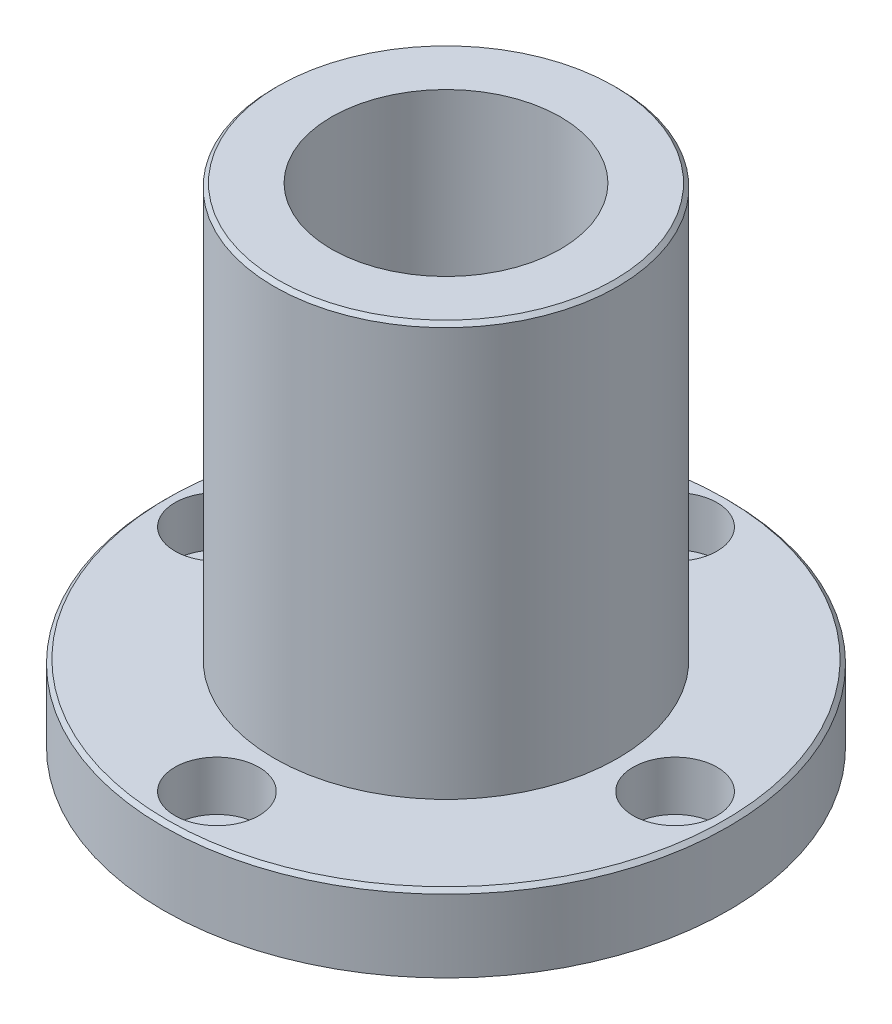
ISO-10303-21;
HEADER;
FILE_DESCRIPTION(('STEP AP214'),'2;1');
FILE_NAME('part.step','',(''),(''),'','','');
FILE_SCHEMA(('AUTOMOTIVE_DESIGN { 1 0 10303 214 1 1 1 1 }'));
ENDSEC;
DATA;
#1=APPLICATION_CONTEXT('core data for automotive mechanical design processes');
#2=APPLICATION_PROTOCOL_DEFINITION('international standard','automotive_design',2000,#1);
#3=PRODUCT_CONTEXT('',#1,'mechanical');
#4=PRODUCT('Part','Part','',(#3));
#5=PRODUCT_RELATED_PRODUCT_CATEGORY('part','',(#4));
#6=PRODUCT_DEFINITION_FORMATION('','',#4);
#7=PRODUCT_DEFINITION_CONTEXT('part definition',#1,'design');
#8=PRODUCT_DEFINITION('design','',#6,#7);
#9=PRODUCT_DEFINITION_SHAPE('','',#8);
#10=(LENGTH_UNIT() NAMED_UNIT(*) SI_UNIT(.MILLI.,.METRE.));
#11=(NAMED_UNIT(*) PLANE_ANGLE_UNIT() SI_UNIT($,.RADIAN.));
#12=(NAMED_UNIT(*) SI_UNIT($,.STERADIAN.) SOLID_ANGLE_UNIT());
#13=UNCERTAINTY_MEASURE_WITH_UNIT(LENGTH_MEASURE(1.E-05),#10,'distance_accuracy_value','');
#14=(GEOMETRIC_REPRESENTATION_CONTEXT(3) GLOBAL_UNCERTAINTY_ASSIGNED_CONTEXT((#13)) GLOBAL_UNIT_ASSIGNED_CONTEXT((#10,
#11,#12)) REPRESENTATION_CONTEXT('',''));
#15=CARTESIAN_POINT('',(0.,0.,0.));
#16=DIRECTION('',(0.,0.,1.));
#17=DIRECTION('',(1.,0.,0.));
#18=AXIS2_PLACEMENT_3D('',#15,#16,#17);
#19=CARTESIAN_POINT('',(0.,63.5,0.));
#20=DIRECTION('',(0.,-1.,0.));
#21=DIRECTION('',(0.,0.,-1.));
#22=AXIS2_PLACEMENT_3D('',#19,#20,#21);
#23=CONICAL_SURFACE('',#22,22.5,0.785398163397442);
#24=CARTESIAN_POINT('',(0.,63.5,0.));
#25=DIRECTION('',(0.,-1.,0.));
#26=DIRECTION('',(0.,0.,-1.));
#27=AXIS2_PLACEMENT_3D('',#24,#25,#26);
#28=CIRCLE('',#27,22.5);
#29=CARTESIAN_POINT('',(0.,63.5,-22.5));
#30=VERTEX_POINT('',#29);
#31=CARTESIAN_POINT('',(0.,63.5,22.5));
#32=VERTEX_POINT('',#31);
#33=EDGE_CURVE('E166',#30,#32,#28,.T.);
#34=ORIENTED_EDGE('',*,*,#33,.F.);
#35=CARTESIAN_POINT('',(0.,63.5,0.));
#36=DIRECTION('',(0.,-1.,0.));
#37=DIRECTION('',(0.,0.,-1.));
#38=AXIS2_PLACEMENT_3D('',#35,#36,#37);
#39=CIRCLE('',#38,22.5);
#40=EDGE_CURVE('E165',#32,#30,#39,.T.);
#41=ORIENTED_EDGE('',*,*,#40,.F.);
#42=DIRECTION('',(0.,0.707106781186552,-0.707106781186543));
#43=VECTOR('',#42,1.);
#44=CARTESIAN_POINT('',(0.,63.5,22.5));
#45=LINE('',#44,#43);
#46=CARTESIAN_POINT('',(0.,64.,22.));
#47=VERTEX_POINT('',#46);
#48=EDGE_CURVE('E250',#32,#47,#45,.T.);
#49=ORIENTED_EDGE('',*,*,#48,.T.);
#50=CARTESIAN_POINT('',(0.,64.,0.));
#51=DIRECTION('',(0.,1.,0.));
#52=DIRECTION('',(0.,0.,-1.));
#53=AXIS2_PLACEMENT_3D('',#50,#51,#52);
#54=CIRCLE('',#53,22.);
#55=CARTESIAN_POINT('',(0.,64.,-22.));
#56=VERTEX_POINT('',#55);
#57=EDGE_CURVE('E170',#56,#47,#54,.T.);
#58=ORIENTED_EDGE('',*,*,#57,.F.);
#59=CARTESIAN_POINT('',(0.,64.,0.));
#60=DIRECTION('',(0.,1.,0.));
#61=DIRECTION('',(0.,0.,-1.));
#62=AXIS2_PLACEMENT_3D('',#59,#60,#61);
#63=CIRCLE('',#62,22.);
#64=EDGE_CURVE('E174',#47,#56,#63,.T.);
#65=ORIENTED_EDGE('',*,*,#64,.F.);
#66=ORIENTED_EDGE('',*,*,#48,.F.);
#67=EDGE_LOOP('',(#34,#41,#49,#58,#65,#66));
#68=FACE_BOUND('',#67,.T.);
#69=ADVANCED_FACE('F58',(#68),#23,.T.);
#70=CARTESIAN_POINT('',(0.,10.,-30.));
#71=DIRECTION('',(0.,1.,0.));
#72=DIRECTION('',(0.,0.,1.));
#73=AXIS2_PLACEMENT_3D('',#70,#71,#72);
#74=CYLINDRICAL_SURFACE('',#73,5.5);
#75=CARTESIAN_POINT('',(0.,3.5,-30.));
#76=DIRECTION('',(0.,1.,0.));
#77=DIRECTION('',(0.,0.,1.));
#78=AXIS2_PLACEMENT_3D('',#75,#76,#77);
#79=CIRCLE('',#78,5.5);
#80=CARTESIAN_POINT('',(0.,3.5,-24.5));
#81=VERTEX_POINT('',#80);
#82=CARTESIAN_POINT('',(0.,3.5,-35.5));
#83=VERTEX_POINT('',#82);
#84=EDGE_CURVE('E122',#81,#83,#79,.T.);
#85=ORIENTED_EDGE('',*,*,#84,.F.);
#86=CARTESIAN_POINT('',(0.,3.5,-30.));
#87=DIRECTION('',(0.,1.,0.));
#88=DIRECTION('',(0.,0.,1.));
#89=AXIS2_PLACEMENT_3D('',#86,#87,#88);
#90=CIRCLE('',#89,5.5);
#91=EDGE_CURVE('E247',#83,#81,#90,.T.);
#92=ORIENTED_EDGE('',*,*,#91,.F.);
#93=DIRECTION('',(0.,1.,0.));
#94=VECTOR('',#93,1.);
#95=CARTESIAN_POINT('',(0.,10.,-35.5));
#96=LINE('',#95,#94);
#97=CARTESIAN_POINT('',(0.,10.,-35.5));
#98=VERTEX_POINT('',#97);
#99=EDGE_CURVE('E80',#83,#98,#96,.T.);
#100=ORIENTED_EDGE('',*,*,#99,.T.);
#101=CARTESIAN_POINT('',(0.,10.,-30.));
#102=DIRECTION('',(0.,1.,0.));
#103=DIRECTION('',(0.,0.,1.));
#104=AXIS2_PLACEMENT_3D('',#101,#102,#103);
#105=CIRCLE('',#104,5.5);
#106=CARTESIAN_POINT('',(0.,10.,-24.5));
#107=VERTEX_POINT('',#106);
#108=EDGE_CURVE('E366',#98,#107,#105,.T.);
#109=ORIENTED_EDGE('',*,*,#108,.T.);
#110=CARTESIAN_POINT('',(0.,10.,-30.));
#111=DIRECTION('',(0.,1.,0.));
#112=DIRECTION('',(0.,0.,1.));
#113=AXIS2_PLACEMENT_3D('',#110,#111,#112);
#114=CIRCLE('',#113,5.5);
#115=EDGE_CURVE('E364',#107,#98,#114,.T.);
#116=ORIENTED_EDGE('',*,*,#115,.T.);
#117=ORIENTED_EDGE('',*,*,#99,.F.);
#118=EDGE_LOOP('',(#85,#92,#100,#109,#116,#117));
#119=FACE_BOUND('',#118,.T.);
#120=ADVANCED_FACE('F271',(#119),#74,.F.);
#121=CARTESIAN_POINT('',(3.3,3.5,-30.));
#122=DIRECTION('',(0.,-1.,0.));
#123=DIRECTION('',(0.,0.,-1.));
#124=AXIS2_PLACEMENT_3D('',#121,#122,#123);
#125=PLANE('',#124);
#126=CARTESIAN_POINT('',(0.,3.5,-30.));
#127=DIRECTION('',(0.,1.,0.));
#128=DIRECTION('',(0.,0.,1.));
#129=AXIS2_PLACEMENT_3D('',#126,#127,#128);
#130=CIRCLE('',#129,3.3);
#131=CARTESIAN_POINT('',(0.,3.5,-26.7));
#132=VERTEX_POINT('',#131);
#133=CARTESIAN_POINT('',(0.,3.5,-33.3));
#134=VERTEX_POINT('',#133);
#135=EDGE_CURVE('E113',#132,#134,#130,.T.);
#136=ORIENTED_EDGE('',*,*,#135,.F.);
#137=CARTESIAN_POINT('',(0.,3.5,-30.));
#138=DIRECTION('',(0.,1.,0.));
#139=DIRECTION('',(0.,0.,1.));
#140=AXIS2_PLACEMENT_3D('',#137,#138,#139);
#141=CIRCLE('',#140,3.3);
#142=EDGE_CURVE('E117',#134,#132,#141,.T.);
#143=ORIENTED_EDGE('',*,*,#142,.F.);
#144=EDGE_LOOP('',(#136,#143));
#145=FACE_BOUND('',#144,.T.);
#146=ORIENTED_EDGE('',*,*,#84,.T.);
#147=ORIENTED_EDGE('',*,*,#91,.T.);
#148=EDGE_LOOP('',(#146,#147));
#149=FACE_BOUND('',#148,.T.);
#150=ADVANCED_FACE('F115',(#145,#149),#125,.F.);
#151=CARTESIAN_POINT('',(0.,10.,-30.));
#152=DIRECTION('',(0.,1.,0.));
#153=DIRECTION('',(0.,0.,1.));
#154=AXIS2_PLACEMENT_3D('',#151,#152,#153);
#155=CYLINDRICAL_SURFACE('',#154,3.3);
#156=CARTESIAN_POINT('',(0.,0.,-30.));
#157=DIRECTION('',(0.,1.,0.));
#158=DIRECTION('',(0.,0.,1.));
#159=AXIS2_PLACEMENT_3D('',#156,#157,#158);
#160=CIRCLE('',#159,3.3);
#161=CARTESIAN_POINT('',(0.,0.,-26.7));
#162=VERTEX_POINT('',#161);
#163=CARTESIAN_POINT('',(0.,0.,-33.3));
#164=VERTEX_POINT('',#163);
#165=EDGE_CURVE('E749',#162,#164,#160,.T.);
#166=ORIENTED_EDGE('',*,*,#165,.F.);
#167=CARTESIAN_POINT('',(0.,0.,-30.));
#168=DIRECTION('',(0.,1.,0.));
#169=DIRECTION('',(0.,0.,1.));
#170=AXIS2_PLACEMENT_3D('',#167,#168,#169);
#171=CIRCLE('',#170,3.3);
#172=EDGE_CURVE('E743',#164,#162,#171,.T.);
#173=ORIENTED_EDGE('',*,*,#172,.F.);
#174=DIRECTION('',(0.,1.,0.));
#175=VECTOR('',#174,1.);
#176=CARTESIAN_POINT('',(0.,10.,-33.3));
#177=LINE('',#176,#175);
#178=EDGE_CURVE('E127',#164,#134,#177,.T.);
#179=ORIENTED_EDGE('',*,*,#178,.T.);
#180=ORIENTED_EDGE('',*,*,#142,.T.);
#181=ORIENTED_EDGE('',*,*,#135,.T.);
#182=ORIENTED_EDGE('',*,*,#178,.F.);
#183=EDGE_LOOP('',(#166,#173,#179,#180,#181,#182));
#184=FACE_BOUND('',#183,.T.);
#185=ADVANCED_FACE('F125',(#184),#155,.F.);
#186=CARTESIAN_POINT('',(30.,10.,0.));
#187=DIRECTION('',(0.,1.,0.));
#188=DIRECTION('',(0.,0.,1.));
#189=AXIS2_PLACEMENT_3D('',#186,#187,#188);
#190=CYLINDRICAL_SURFACE('',#189,5.5);
#191=CARTESIAN_POINT('',(30.,3.5,0.));
#192=DIRECTION('',(0.,1.,0.));
#193=DIRECTION('',(0.,0.,1.));
#194=AXIS2_PLACEMENT_3D('',#191,#192,#193);
#195=CIRCLE('',#194,5.5);
#196=CARTESIAN_POINT('',(30.,3.5,5.5));
#197=VERTEX_POINT('',#196);
#198=CARTESIAN_POINT('',(30.,3.5,-5.5));
#199=VERTEX_POINT('',#198);
#200=EDGE_CURVE('E225',#197,#199,#195,.T.);
#201=ORIENTED_EDGE('',*,*,#200,.F.);
#202=CARTESIAN_POINT('',(30.,3.5,0.));
#203=DIRECTION('',(0.,1.,0.));
#204=DIRECTION('',(0.,0.,1.));
#205=AXIS2_PLACEMENT_3D('',#202,#203,#204);
#206=CIRCLE('',#205,5.5);
#207=EDGE_CURVE('E187',#199,#197,#206,.T.);
#208=ORIENTED_EDGE('',*,*,#207,.F.);
#209=DIRECTION('',(0.,1.,0.));
#210=VECTOR('',#209,1.);
#211=CARTESIAN_POINT('',(30.,10.,-5.5));
#212=LINE('',#211,#210);
#213=CARTESIAN_POINT('',(30.,10.,-5.5));
#214=VERTEX_POINT('',#213);
#215=EDGE_CURVE('E132',#199,#214,#212,.T.);
#216=ORIENTED_EDGE('',*,*,#215,.T.);
#217=CARTESIAN_POINT('',(30.,10.,0.));
#218=DIRECTION('',(0.,1.,0.));
#219=DIRECTION('',(0.,0.,1.));
#220=AXIS2_PLACEMENT_3D('',#217,#218,#219);
#221=CIRCLE('',#220,5.5);
#222=CARTESIAN_POINT('',(30.,10.,5.5));
#223=VERTEX_POINT('',#222);
#224=EDGE_CURVE('E395',#214,#223,#221,.T.);
#225=ORIENTED_EDGE('',*,*,#224,.T.);
#226=CARTESIAN_POINT('',(30.,10.,0.));
#227=DIRECTION('',(0.,1.,0.));
#228=DIRECTION('',(0.,0.,1.));
#229=AXIS2_PLACEMENT_3D('',#226,#227,#228);
#230=CIRCLE('',#229,5.5);
#231=EDGE_CURVE('E392',#223,#214,#230,.T.);
#232=ORIENTED_EDGE('',*,*,#231,.T.);
#233=ORIENTED_EDGE('',*,*,#215,.F.);
#234=EDGE_LOOP('',(#201,#208,#216,#225,#232,#233));
#235=FACE_BOUND('',#234,.T.);
#236=ADVANCED_FACE('F283',(#235),#190,.F.);
#237=CARTESIAN_POINT('',(33.3,3.5,0.));
#238=DIRECTION('',(0.,-1.,0.));
#239=DIRECTION('',(0.,0.,-1.));
#240=AXIS2_PLACEMENT_3D('',#237,#238,#239);
#241=PLANE('',#240);
#242=CARTESIAN_POINT('',(30.,3.5,0.));
#243=DIRECTION('',(0.,1.,0.));
#244=DIRECTION('',(0.,0.,1.));
#245=AXIS2_PLACEMENT_3D('',#242,#243,#244);
#246=CIRCLE('',#245,3.3);
#247=CARTESIAN_POINT('',(30.,3.5,3.3));
#248=VERTEX_POINT('',#247);
#249=CARTESIAN_POINT('',(30.,3.5,-3.3));
#250=VERTEX_POINT('',#249);
#251=EDGE_CURVE('E238',#248,#250,#246,.T.);
#252=ORIENTED_EDGE('',*,*,#251,.F.);
#253=CARTESIAN_POINT('',(30.,3.5,0.));
#254=DIRECTION('',(0.,1.,0.));
#255=DIRECTION('',(0.,0.,1.));
#256=AXIS2_PLACEMENT_3D('',#253,#254,#255);
#257=CIRCLE('',#256,3.3);
#258=EDGE_CURVE('E234',#250,#248,#257,.T.);
#259=ORIENTED_EDGE('',*,*,#258,.F.);
#260=EDGE_LOOP('',(#252,#259));
#261=FACE_BOUND('',#260,.T.);
#262=ORIENTED_EDGE('',*,*,#200,.T.);
#263=ORIENTED_EDGE('',*,*,#207,.T.);
#264=EDGE_LOOP('',(#262,#263));
#265=FACE_BOUND('',#264,.T.);
#266=ADVANCED_FACE('F284',(#261,#265),#241,.F.);
#267=CARTESIAN_POINT('',(30.,10.,0.));
#268=DIRECTION('',(0.,1.,0.));
#269=DIRECTION('',(0.,0.,1.));
#270=AXIS2_PLACEMENT_3D('',#267,#268,#269);
#271=CYLINDRICAL_SURFACE('',#270,3.3);
#272=CARTESIAN_POINT('',(30.,0.,0.));
#273=DIRECTION('',(0.,1.,0.));
#274=DIRECTION('',(0.,0.,1.));
#275=AXIS2_PLACEMENT_3D('',#272,#273,#274);
#276=CIRCLE('',#275,3.3);
#277=CARTESIAN_POINT('',(30.,0.,3.3));
#278=VERTEX_POINT('',#277);
#279=CARTESIAN_POINT('',(30.,0.,-3.3));
#280=VERTEX_POINT('',#279);
#281=EDGE_CURVE('E359',#278,#280,#276,.T.);
#282=ORIENTED_EDGE('',*,*,#281,.F.);
#283=CARTESIAN_POINT('',(30.,0.,0.));
#284=DIRECTION('',(0.,1.,0.));
#285=DIRECTION('',(0.,0.,1.));
#286=AXIS2_PLACEMENT_3D('',#283,#284,#285);
#287=CIRCLE('',#286,3.3);
#288=EDGE_CURVE('E351',#280,#278,#287,.T.);
#289=ORIENTED_EDGE('',*,*,#288,.F.);
#290=DIRECTION('',(0.,1.,0.));
#291=VECTOR('',#290,1.);
#292=CARTESIAN_POINT('',(30.,10.,-3.3));
#293=LINE('',#292,#291);
#294=EDGE_CURVE('E233',#280,#250,#293,.T.);
#295=ORIENTED_EDGE('',*,*,#294,.T.);
#296=ORIENTED_EDGE('',*,*,#258,.T.);
#297=ORIENTED_EDGE('',*,*,#251,.T.);
#298=ORIENTED_EDGE('',*,*,#294,.F.);
#299=EDGE_LOOP('',(#282,#289,#295,#296,#297,#298));
#300=FACE_BOUND('',#299,.T.);
#301=ADVANCED_FACE('F287',(#300),#271,.F.);
#302=CARTESIAN_POINT('',(0.,10.,30.));
#303=DIRECTION('',(0.,1.,0.));
#304=DIRECTION('',(0.,0.,1.));
#305=AXIS2_PLACEMENT_3D('',#302,#303,#304);
#306=CYLINDRICAL_SURFACE('',#305,5.5);
#307=CARTESIAN_POINT('',(0.,3.5,30.));
#308=DIRECTION('',(0.,1.,0.));
#309=DIRECTION('',(0.,0.,1.));
#310=AXIS2_PLACEMENT_3D('',#307,#308,#309);
#311=CIRCLE('',#310,5.5);
#312=CARTESIAN_POINT('',(0.,3.5,35.5));
#313=VERTEX_POINT('',#312);
#314=CARTESIAN_POINT('',(0.,3.5,24.5));
#315=VERTEX_POINT('',#314);
#316=EDGE_CURVE('E218',#313,#315,#311,.T.);
#317=ORIENTED_EDGE('',*,*,#316,.F.);
#318=CARTESIAN_POINT('',(0.,3.5,30.));
#319=DIRECTION('',(0.,1.,0.));
#320=DIRECTION('',(0.,0.,1.));
#321=AXIS2_PLACEMENT_3D('',#318,#319,#320);
#322=CIRCLE('',#321,5.5);
#323=EDGE_CURVE('E222',#315,#313,#322,.T.);
#324=ORIENTED_EDGE('',*,*,#323,.F.);
#325=DIRECTION('',(0.,1.,0.));
#326=VECTOR('',#325,1.);
#327=CARTESIAN_POINT('',(0.,10.,24.5));
#328=LINE('',#327,#326);
#329=CARTESIAN_POINT('',(0.,10.,24.5));
#330=VERTEX_POINT('',#329);
#331=EDGE_CURVE('E229',#315,#330,#328,.T.);
#332=ORIENTED_EDGE('',*,*,#331,.T.);
#333=CARTESIAN_POINT('',(0.,10.,30.));
#334=DIRECTION('',(0.,1.,0.));
#335=DIRECTION('',(0.,0.,1.));
#336=AXIS2_PLACEMENT_3D('',#333,#334,#335);
#337=CIRCLE('',#336,5.5);
#338=CARTESIAN_POINT('',(0.,10.,35.5));
#339=VERTEX_POINT('',#338);
#340=EDGE_CURVE('E138',#330,#339,#337,.T.);
#341=ORIENTED_EDGE('',*,*,#340,.T.);
#342=CARTESIAN_POINT('',(0.,10.,30.));
#343=DIRECTION('',(0.,1.,0.));
#344=DIRECTION('',(0.,0.,1.));
#345=AXIS2_PLACEMENT_3D('',#342,#343,#344);
#346=CIRCLE('',#345,5.5);
#347=EDGE_CURVE('E136',#339,#330,#346,.T.);
#348=ORIENTED_EDGE('',*,*,#347,.T.);
#349=ORIENTED_EDGE('',*,*,#331,.F.);
#350=EDGE_LOOP('',(#317,#324,#332,#341,#348,#349));
#351=FACE_BOUND('',#350,.T.);
#352=ADVANCED_FACE('F293',(#351),#306,.F.);
#353=CARTESIAN_POINT('',(3.3,3.5,30.));
#354=DIRECTION('',(0.,-1.,0.));
#355=DIRECTION('',(0.,0.,-1.));
#356=AXIS2_PLACEMENT_3D('',#353,#354,#355);
#357=PLANE('',#356);
#358=CARTESIAN_POINT('',(0.,3.5,30.));
#359=DIRECTION('',(0.,1.,0.));
#360=DIRECTION('',(0.,0.,1.));
#361=AXIS2_PLACEMENT_3D('',#358,#359,#360);
#362=CIRCLE('',#361,3.3);
#363=CARTESIAN_POINT('',(0.,3.5,33.3));
#364=VERTEX_POINT('',#363);
#365=CARTESIAN_POINT('',(0.,3.5,26.7));
#366=VERTEX_POINT('',#365);
#367=EDGE_CURVE('E155',#364,#366,#362,.T.);
#368=ORIENTED_EDGE('',*,*,#367,.F.);
#369=CARTESIAN_POINT('',(0.,3.5,30.));
#370=DIRECTION('',(0.,1.,0.));
#371=DIRECTION('',(0.,0.,1.));
#372=AXIS2_PLACEMENT_3D('',#369,#370,#371);
#373=CIRCLE('',#372,3.3);
#374=EDGE_CURVE('E151',#366,#364,#373,.T.);
#375=ORIENTED_EDGE('',*,*,#374,.F.);
#376=EDGE_LOOP('',(#368,#375));
#377=FACE_BOUND('',#376,.T.);
#378=ORIENTED_EDGE('',*,*,#316,.T.);
#379=ORIENTED_EDGE('',*,*,#323,.T.);
#380=EDGE_LOOP('',(#378,#379));
#381=FACE_BOUND('',#380,.T.);
#382=ADVANCED_FACE('F289',(#377,#381),#357,.F.);
#383=CARTESIAN_POINT('',(0.,10.,30.));
#384=DIRECTION('',(0.,1.,0.));
#385=DIRECTION('',(0.,0.,1.));
#386=AXIS2_PLACEMENT_3D('',#383,#384,#385);
#387=CYLINDRICAL_SURFACE('',#386,3.3);
#388=CARTESIAN_POINT('',(0.,0.,30.));
#389=DIRECTION('',(0.,1.,0.));
#390=DIRECTION('',(0.,0.,1.));
#391=AXIS2_PLACEMENT_3D('',#388,#389,#390);
#392=CIRCLE('',#391,3.3);
#393=CARTESIAN_POINT('',(0.,0.,33.3));
#394=VERTEX_POINT('',#393);
#395=CARTESIAN_POINT('',(0.,0.,26.7));
#396=VERTEX_POINT('',#395);
#397=EDGE_CURVE('E342',#394,#396,#392,.T.);
#398=ORIENTED_EDGE('',*,*,#397,.F.);
#399=CARTESIAN_POINT('',(0.,0.,30.));
#400=DIRECTION('',(0.,1.,0.));
#401=DIRECTION('',(0.,0.,1.));
#402=AXIS2_PLACEMENT_3D('',#399,#400,#401);
#403=CIRCLE('',#402,3.3);
#404=EDGE_CURVE('E345',#396,#394,#403,.T.);
#405=ORIENTED_EDGE('',*,*,#404,.F.);
#406=DIRECTION('',(0.,1.,0.));
#407=VECTOR('',#406,1.);
#408=CARTESIAN_POINT('',(0.,10.,26.7));
#409=LINE('',#408,#407);
#410=EDGE_CURVE('E156',#396,#366,#409,.T.);
#411=ORIENTED_EDGE('',*,*,#410,.T.);
#412=ORIENTED_EDGE('',*,*,#374,.T.);
#413=ORIENTED_EDGE('',*,*,#367,.T.);
#414=ORIENTED_EDGE('',*,*,#410,.F.);
#415=EDGE_LOOP('',(#398,#405,#411,#412,#413,#414));
#416=FACE_BOUND('',#415,.T.);
#417=ADVANCED_FACE('F292',(#416),#387,.F.);
#418=CARTESIAN_POINT('',(-30.,10.,0.));
#419=DIRECTION('',(0.,1.,0.));
#420=DIRECTION('',(0.,0.,1.));
#421=AXIS2_PLACEMENT_3D('',#418,#419,#420);
#422=CYLINDRICAL_SURFACE('',#421,5.5);
#423=CARTESIAN_POINT('',(-30.,3.5,0.));
#424=DIRECTION('',(0.,1.,0.));
#425=DIRECTION('',(0.,0.,1.));
#426=AXIS2_PLACEMENT_3D('',#423,#424,#425);
#427=CIRCLE('',#426,5.5);
#428=CARTESIAN_POINT('',(-30.,3.5,5.5));
#429=VERTEX_POINT('',#428);
#430=CARTESIAN_POINT('',(-30.,3.5,-5.5));
#431=VERTEX_POINT('',#430);
#432=EDGE_CURVE('E200',#429,#431,#427,.T.);
#433=ORIENTED_EDGE('',*,*,#432,.F.);
#434=CARTESIAN_POINT('',(-30.,3.5,0.));
#435=DIRECTION('',(0.,1.,0.));
#436=DIRECTION('',(0.,0.,1.));
#437=AXIS2_PLACEMENT_3D('',#434,#435,#436);
#438=CIRCLE('',#437,5.5);
#439=EDGE_CURVE('E204',#431,#429,#438,.T.);
#440=ORIENTED_EDGE('',*,*,#439,.F.);
#441=DIRECTION('',(0.,1.,0.));
#442=VECTOR('',#441,1.);
#443=CARTESIAN_POINT('',(-30.,10.,-5.5));
#444=LINE('',#443,#442);
#445=CARTESIAN_POINT('',(-30.,10.,-5.5));
#446=VERTEX_POINT('',#445);
#447=EDGE_CURVE('E208',#431,#446,#444,.T.);
#448=ORIENTED_EDGE('',*,*,#447,.T.);
#449=CARTESIAN_POINT('',(-30.,10.,0.));
#450=DIRECTION('',(0.,1.,0.));
#451=DIRECTION('',(0.,0.,1.));
#452=AXIS2_PLACEMENT_3D('',#449,#450,#451);
#453=CIRCLE('',#452,5.5);
#454=CARTESIAN_POINT('',(-30.,10.,5.5));
#455=VERTEX_POINT('',#454);
#456=EDGE_CURVE('E146',#446,#455,#453,.T.);
#457=ORIENTED_EDGE('',*,*,#456,.T.);
#458=CARTESIAN_POINT('',(-30.,10.,0.));
#459=DIRECTION('',(0.,1.,0.));
#460=DIRECTION('',(0.,0.,1.));
#461=AXIS2_PLACEMENT_3D('',#458,#459,#460);
#462=CIRCLE('',#461,5.5);
#463=EDGE_CURVE('E142',#455,#446,#462,.T.);
#464=ORIENTED_EDGE('',*,*,#463,.T.);
#465=ORIENTED_EDGE('',*,*,#447,.F.);
#466=EDGE_LOOP('',(#433,#440,#448,#457,#464,#465));
#467=FACE_BOUND('',#466,.T.);
#468=ADVANCED_FACE('F299',(#467),#422,.F.);
#469=CARTESIAN_POINT('',(-26.7,3.5,0.));
#470=DIRECTION('',(0.,-1.,0.));
#471=DIRECTION('',(0.,0.,-1.));
#472=AXIS2_PLACEMENT_3D('',#469,#470,#471);
#473=PLANE('',#472);
#474=CARTESIAN_POINT('',(-30.,3.5,0.));
#475=DIRECTION('',(0.,1.,0.));
#476=DIRECTION('',(0.,0.,1.));
#477=AXIS2_PLACEMENT_3D('',#474,#475,#476);
#478=CIRCLE('',#477,3.3);
#479=CARTESIAN_POINT('',(-30.,3.5,3.3));
#480=VERTEX_POINT('',#479);
#481=CARTESIAN_POINT('',(-30.,3.5,-3.3));
#482=VERTEX_POINT('',#481);
#483=EDGE_CURVE('E199',#480,#482,#478,.T.);
#484=ORIENTED_EDGE('',*,*,#483,.F.);
#485=CARTESIAN_POINT('',(-30.,3.5,0.));
#486=DIRECTION('',(0.,1.,0.));
#487=DIRECTION('',(0.,0.,1.));
#488=AXIS2_PLACEMENT_3D('',#485,#486,#487);
#489=CIRCLE('',#488,3.3);
#490=EDGE_CURVE('E195',#482,#480,#489,.T.);
#491=ORIENTED_EDGE('',*,*,#490,.F.);
#492=EDGE_LOOP('',(#484,#491));
#493=FACE_BOUND('',#492,.T.);
#494=ORIENTED_EDGE('',*,*,#432,.T.);
#495=ORIENTED_EDGE('',*,*,#439,.T.);
#496=EDGE_LOOP('',(#494,#495));
#497=FACE_BOUND('',#496,.T.);
#498=ADVANCED_FACE('F295',(#493,#497),#473,.F.);
#499=CARTESIAN_POINT('',(-30.,10.,0.));
#500=DIRECTION('',(0.,1.,0.));
#501=DIRECTION('',(0.,0.,1.));
#502=AXIS2_PLACEMENT_3D('',#499,#500,#501);
#503=CYLINDRICAL_SURFACE('',#502,3.3);
#504=CARTESIAN_POINT('',(-30.,0.,0.));
#505=DIRECTION('',(0.,1.,0.));
#506=DIRECTION('',(0.,0.,1.));
#507=AXIS2_PLACEMENT_3D('',#504,#505,#506);
#508=CIRCLE('',#507,3.3);
#509=CARTESIAN_POINT('',(-30.,0.,3.3));
#510=VERTEX_POINT('',#509);
#511=CARTESIAN_POINT('',(-30.,0.,-3.3));
#512=VERTEX_POINT('',#511);
#513=EDGE_CURVE('E356',#510,#512,#508,.T.);
#514=ORIENTED_EDGE('',*,*,#513,.F.);
#515=CARTESIAN_POINT('',(-30.,0.,0.));
#516=DIRECTION('',(0.,1.,0.));
#517=DIRECTION('',(0.,0.,1.));
#518=AXIS2_PLACEMENT_3D('',#515,#516,#517);
#519=CIRCLE('',#518,3.3);
#520=EDGE_CURVE('E375',#512,#510,#519,.T.);
#521=ORIENTED_EDGE('',*,*,#520,.F.);
#522=DIRECTION('',(0.,1.,0.));
#523=VECTOR('',#522,1.);
#524=CARTESIAN_POINT('',(-30.,10.,-3.3));
#525=LINE('',#524,#523);
#526=EDGE_CURVE('E191',#512,#482,#525,.T.);
#527=ORIENTED_EDGE('',*,*,#526,.T.);
#528=ORIENTED_EDGE('',*,*,#490,.T.);
#529=ORIENTED_EDGE('',*,*,#483,.T.);
#530=ORIENTED_EDGE('',*,*,#526,.F.);
#531=EDGE_LOOP('',(#514,#521,#527,#528,#529,#530));
#532=FACE_BOUND('',#531,.T.);
#533=ADVANCED_FACE('F298',(#532),#503,.F.);
#534=CARTESIAN_POINT('',(0.,64.,0.));
#535=DIRECTION('',(0.,-1.,0.));
#536=DIRECTION('',(0.,0.,-1.));
#537=AXIS2_PLACEMENT_3D('',#534,#535,#536);
#538=CYLINDRICAL_SURFACE('',#537,15.);
#539=CARTESIAN_POINT('',(0.,64.,0.));
#540=DIRECTION('',(0.,-1.,0.));
#541=DIRECTION('',(0.,0.,-1.));
#542=AXIS2_PLACEMENT_3D('',#539,#540,#541);
#543=CIRCLE('',#542,15.);
#544=CARTESIAN_POINT('',(0.,64.,-15.));
#545=VERTEX_POINT('',#544);
#546=CARTESIAN_POINT('',(0.,64.,15.));
#547=VERTEX_POINT('',#546);
#548=EDGE_CURVE('E178',#545,#547,#543,.T.);
#549=ORIENTED_EDGE('',*,*,#548,.F.);
#550=CARTESIAN_POINT('',(0.,64.,0.));
#551=DIRECTION('',(0.,-1.,0.));
#552=DIRECTION('',(0.,0.,-1.));
#553=AXIS2_PLACEMENT_3D('',#550,#551,#552);
#554=CIRCLE('',#553,15.);
#555=EDGE_CURVE('E179',#547,#545,#554,.T.);
#556=ORIENTED_EDGE('',*,*,#555,.F.);
#557=DIRECTION('',(0.,-1.,0.));
#558=VECTOR('',#557,1.);
#559=CARTESIAN_POINT('',(0.,64.,15.));
#560=LINE('',#559,#558);
#561=CARTESIAN_POINT('',(0.,0.,15.));
#562=VERTEX_POINT('',#561);
#563=EDGE_CURVE('E183',#547,#562,#560,.T.);
#564=ORIENTED_EDGE('',*,*,#563,.T.);
#565=CARTESIAN_POINT('',(0.,0.,0.));
#566=DIRECTION('',(0.,-1.,0.));
#567=DIRECTION('',(0.,0.,-1.));
#568=AXIS2_PLACEMENT_3D('',#565,#566,#567);
#569=CIRCLE('',#568,15.);
#570=CARTESIAN_POINT('',(0.,0.,-15.));
#571=VERTEX_POINT('',#570);
#572=EDGE_CURVE('E367',#562,#571,#569,.T.);
#573=ORIENTED_EDGE('',*,*,#572,.T.);
#574=CARTESIAN_POINT('',(0.,0.,0.));
#575=DIRECTION('',(0.,-1.,0.));
#576=DIRECTION('',(0.,0.,-1.));
#577=AXIS2_PLACEMENT_3D('',#574,#575,#576);
#578=CIRCLE('',#577,15.);
#579=EDGE_CURVE('E379',#571,#562,#578,.T.);
#580=ORIENTED_EDGE('',*,*,#579,.T.);
#581=ORIENTED_EDGE('',*,*,#563,.F.);
#582=EDGE_LOOP('',(#549,#556,#564,#573,#580,#581));
#583=FACE_BOUND('',#582,.T.);
#584=ADVANCED_FACE('F306',(#583),#538,.F.);
#585=CARTESIAN_POINT('',(-22.5,64.,0.));
#586=DIRECTION('',(0.,-1.,0.));
#587=DIRECTION('',(0.,0.,-1.));
#588=AXIS2_PLACEMENT_3D('',#585,#586,#587);
#589=PLANE('',#588);
#590=ORIENTED_EDGE('',*,*,#548,.T.);
#591=ORIENTED_EDGE('',*,*,#555,.T.);
#592=EDGE_LOOP('',(#590,#591));
#593=FACE_BOUND('',#592,.T.);
#594=ORIENTED_EDGE('',*,*,#57,.T.);
#595=ORIENTED_EDGE('',*,*,#64,.T.);
#596=EDGE_LOOP('',(#594,#595));
#597=FACE_BOUND('',#596,.T.);
#598=ADVANCED_FACE('F313',(#593,#597),#589,.F.);
#599=CARTESIAN_POINT('',(0.,0.,0.));
#600=DIRECTION('',(0.,-1.,0.));
#601=DIRECTION('',(0.,0.,-1.));
#602=AXIS2_PLACEMENT_3D('',#599,#600,#601);
#603=CYLINDRICAL_SURFACE('',#602,22.5);
#604=CARTESIAN_POINT('',(0.,10.,0.));
#605=DIRECTION('',(0.,-1.,0.));
#606=DIRECTION('',(0.,0.,-1.));
#607=AXIS2_PLACEMENT_3D('',#604,#605,#606);
#608=CIRCLE('',#607,22.5);
#609=CARTESIAN_POINT('',(0.,10.,-22.5));
#610=VERTEX_POINT('',#609);
#611=CARTESIAN_POINT('',(0.,10.,22.5));
#612=VERTEX_POINT('',#611);
#613=EDGE_CURVE('E150',#610,#612,#608,.T.);
#614=ORIENTED_EDGE('',*,*,#613,.F.);
#615=CARTESIAN_POINT('',(0.,10.,0.));
#616=DIRECTION('',(0.,-1.,0.));
#617=DIRECTION('',(0.,0.,-1.));
#618=AXIS2_PLACEMENT_3D('',#615,#616,#617);
#619=CIRCLE('',#618,22.5);
#620=EDGE_CURVE('E160',#612,#610,#619,.T.);
#621=ORIENTED_EDGE('',*,*,#620,.F.);
#622=DIRECTION('',(0.,1.,0.));
#623=VECTOR('',#622,1.);
#624=CARTESIAN_POINT('',(0.,0.,22.5));
#625=LINE('',#624,#623);
#626=EDGE_CURVE('E161',#612,#32,#625,.T.);
#627=ORIENTED_EDGE('',*,*,#626,.T.);
#628=ORIENTED_EDGE('',*,*,#40,.T.);
#629=ORIENTED_EDGE('',*,*,#33,.T.);
#630=ORIENTED_EDGE('',*,*,#626,.F.);
#631=EDGE_LOOP('',(#614,#621,#627,#628,#629,#630));
#632=FACE_BOUND('',#631,.T.);
#633=ADVANCED_FACE('F317',(#632),#603,.T.);
#634=CARTESIAN_POINT('',(-37.5,10.,0.));
#635=DIRECTION('',(0.,-1.,0.));
#636=DIRECTION('',(0.,0.,-1.));
#637=AXIS2_PLACEMENT_3D('',#634,#635,#636);
#638=PLANE('',#637);
#639=CARTESIAN_POINT('',(0.,10.,0.));
#640=DIRECTION('',(0.,-1.,0.));
#641=DIRECTION('',(0.,0.,-1.));
#642=AXIS2_PLACEMENT_3D('',#639,#640,#641);
#643=CIRCLE('',#642,36.5);
#644=CARTESIAN_POINT('',(0.,10.,-36.5));
#645=VERTEX_POINT('',#644);
#646=EDGE_CURVE('E69',#645,#645,#643,.F.);
#647=ORIENTED_EDGE('',*,*,#646,.T.);
#648=EDGE_LOOP('',(#647));
#649=FACE_BOUND('',#648,.T.);
#650=ORIENTED_EDGE('',*,*,#613,.T.);
#651=ORIENTED_EDGE('',*,*,#620,.T.);
#652=EDGE_LOOP('',(#650,#651));
#653=FACE_BOUND('',#652,.T.);
#654=ORIENTED_EDGE('',*,*,#463,.F.);
#655=ORIENTED_EDGE('',*,*,#456,.F.);
#656=EDGE_LOOP('',(#654,#655));
#657=FACE_BOUND('',#656,.T.);
#658=ORIENTED_EDGE('',*,*,#347,.F.);
#659=ORIENTED_EDGE('',*,*,#340,.F.);
#660=EDGE_LOOP('',(#658,#659));
#661=FACE_BOUND('',#660,.T.);
#662=ORIENTED_EDGE('',*,*,#231,.F.);
#663=ORIENTED_EDGE('',*,*,#224,.F.);
#664=EDGE_LOOP('',(#662,#663));
#665=FACE_BOUND('',#664,.T.);
#666=ORIENTED_EDGE('',*,*,#115,.F.);
#667=ORIENTED_EDGE('',*,*,#108,.F.);
#668=EDGE_LOOP('',(#666,#667));
#669=FACE_BOUND('',#668,.T.);
#670=ADVANCED_FACE('F257',(#649,#653,#657,#661,#665,#669),#638,.F.);
#671=CARTESIAN_POINT('',(0.,0.,0.));
#672=DIRECTION('',(0.,1.,0.));
#673=DIRECTION('',(1.,0.,0.));
#674=AXIS2_PLACEMENT_3D('',#671,#672,#673);
#675=PLANE('',#674);
#676=ORIENTED_EDGE('',*,*,#579,.F.);
#677=ORIENTED_EDGE('',*,*,#572,.F.);
#678=EDGE_LOOP('',(#676,#677));
#679=FACE_BOUND('',#678,.T.);
#680=ORIENTED_EDGE('',*,*,#513,.T.);
#681=ORIENTED_EDGE('',*,*,#520,.T.);
#682=EDGE_LOOP('',(#680,#681));
#683=FACE_BOUND('',#682,.T.);
#684=ORIENTED_EDGE('',*,*,#397,.T.);
#685=ORIENTED_EDGE('',*,*,#404,.T.);
#686=EDGE_LOOP('',(#684,#685));
#687=FACE_BOUND('',#686,.T.);
#688=ORIENTED_EDGE('',*,*,#281,.T.);
#689=ORIENTED_EDGE('',*,*,#288,.T.);
#690=EDGE_LOOP('',(#688,#689));
#691=FACE_BOUND('',#690,.T.);
#692=ORIENTED_EDGE('',*,*,#165,.T.);
#693=ORIENTED_EDGE('',*,*,#172,.T.);
#694=EDGE_LOOP('',(#692,#693));
#695=FACE_BOUND('',#694,.T.);
#696=CARTESIAN_POINT('',(0.,0.,0.));
#697=DIRECTION('',(0.,-1.,0.));
#698=DIRECTION('',(0.,0.,1.));
#699=AXIS2_PLACEMENT_3D('',#696,#697,#698);
#700=CIRCLE('',#699,37.);
#701=CARTESIAN_POINT('',(0.,0.,37.));
#702=VERTEX_POINT('',#701);
#703=EDGE_CURVE('E756',#702,#702,#700,.T.);
#704=ORIENTED_EDGE('',*,*,#703,.T.);
#705=EDGE_LOOP('',(#704));
#706=FACE_BOUND('',#705,.T.);
#707=ADVANCED_FACE('F266',(#679,#683,#687,#691,#695,#706),#675,.F.);
#708=CARTESIAN_POINT('',(0.,0.,0.));
#709=DIRECTION('',(0.,1.,0.));
#710=DIRECTION('',(0.,0.,1.));
#711=AXIS2_PLACEMENT_3D('',#708,#709,#710);
#712=CYLINDRICAL_SURFACE('',#711,37.);
#713=CARTESIAN_POINT('',(0.,9.49999999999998,0.));
#714=DIRECTION('',(0.,-1.,0.));
#715=DIRECTION('',(0.,0.,-1.));
#716=AXIS2_PLACEMENT_3D('',#713,#714,#715);
#717=CIRCLE('',#716,37.);
#718=CARTESIAN_POINT('',(0.,9.49999999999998,-37.));
#719=VERTEX_POINT('',#718);
#720=EDGE_CURVE('E11',#719,#719,#717,.T.);
#721=ORIENTED_EDGE('',*,*,#720,.T.);
#722=EDGE_LOOP('',(#721));
#723=FACE_BOUND('',#722,.T.);
#724=ORIENTED_EDGE('',*,*,#703,.F.);
#725=EDGE_LOOP('',(#724));
#726=FACE_BOUND('',#725,.T.);
#727=ADVANCED_FACE('F261',(#723,#726),#712,.T.);
#728=CARTESIAN_POINT('',(0.,10.,0.));
#729=DIRECTION('',(0.,-1.,0.));
#730=DIRECTION('',(0.,0.,-1.));
#731=AXIS2_PLACEMENT_3D('',#728,#729,#730);
#732=CONICAL_SURFACE('',#731,36.5,0.785398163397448);
#733=ORIENTED_EDGE('',*,*,#720,.F.);
#734=EDGE_LOOP('',(#733));
#735=FACE_BOUND('',#734,.T.);
#736=ORIENTED_EDGE('',*,*,#646,.F.);
#737=EDGE_LOOP('',(#736));
#738=FACE_BOUND('',#737,.T.);
#739=ADVANCED_FACE('F61',(#735,#738),#732,.T.);
#740=CLOSED_SHELL('',(#69,#120,#150,#185,#236,#266,#301,#352,#382,#417,#468,#498,#533,#584,#598,
#633,#670,#707,#727,#739));
#741=MANIFOLD_SOLID_BREP('B2',#740);
#742=ADVANCED_BREP_SHAPE_REPRESENTATION('',(#18,#741),#14);
#743=SHAPE_DEFINITION_REPRESENTATION(#9,#742);
ENDSEC;
END-ISO-10303-21;
